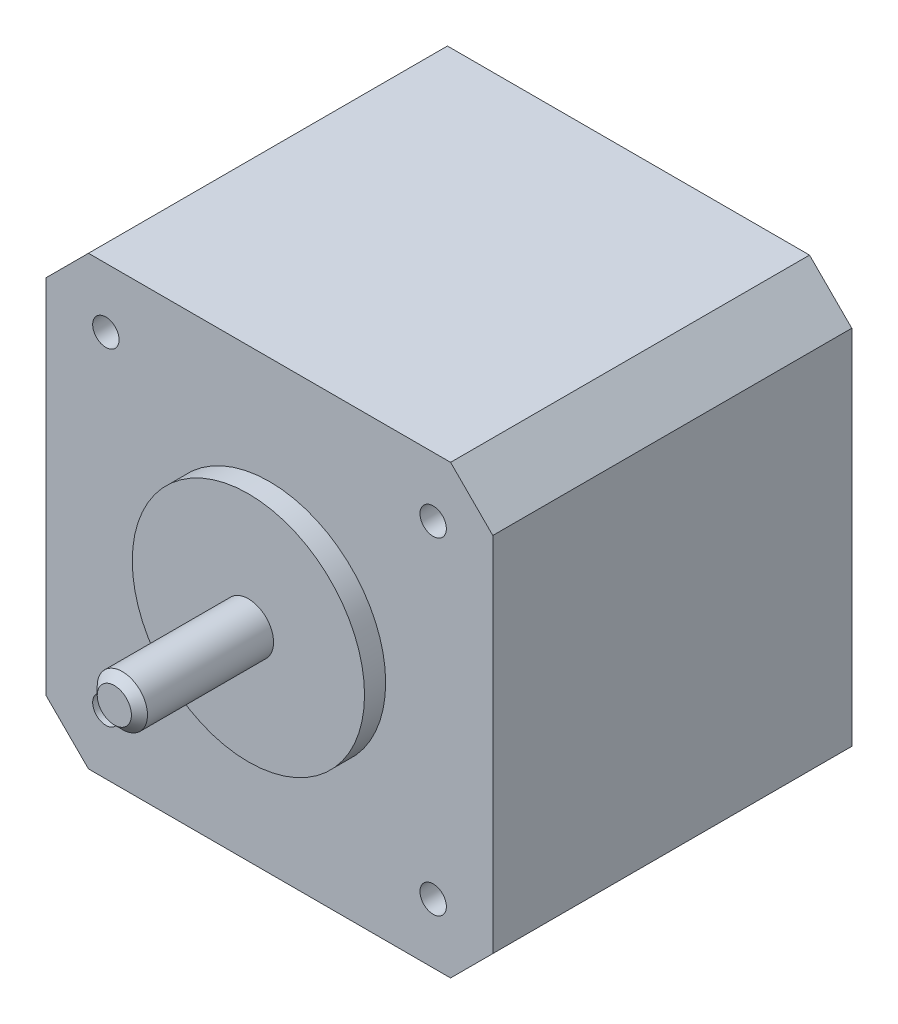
ISO-10303-21;
HEADER;
FILE_DESCRIPTION(('STEP AP214'),'2;1');
FILE_NAME('part.step','',(''),(''),'','','');
FILE_SCHEMA(('AUTOMOTIVE_DESIGN { 1 0 10303 214 1 1 1 1 }'));
ENDSEC;
DATA;
#1=APPLICATION_CONTEXT('core data for automotive mechanical design processes');
#2=APPLICATION_PROTOCOL_DEFINITION('international standard','automotive_design',2000,#1);
#3=PRODUCT_CONTEXT('',#1,'mechanical');
#4=PRODUCT('Part','Part','',(#3));
#5=PRODUCT_RELATED_PRODUCT_CATEGORY('part','',(#4));
#6=PRODUCT_DEFINITION_FORMATION('','',#4);
#7=PRODUCT_DEFINITION_CONTEXT('part definition',#1,'design');
#8=PRODUCT_DEFINITION('design','',#6,#7);
#9=PRODUCT_DEFINITION_SHAPE('','',#8);
#10=(LENGTH_UNIT() NAMED_UNIT(*) SI_UNIT(.MILLI.,.METRE.));
#11=(NAMED_UNIT(*) PLANE_ANGLE_UNIT() SI_UNIT($,.RADIAN.));
#12=(NAMED_UNIT(*) SI_UNIT($,.STERADIAN.) SOLID_ANGLE_UNIT());
#13=UNCERTAINTY_MEASURE_WITH_UNIT(LENGTH_MEASURE(1.E-05),#10,'distance_accuracy_value','');
#14=(GEOMETRIC_REPRESENTATION_CONTEXT(3) GLOBAL_UNCERTAINTY_ASSIGNED_CONTEXT((#13)) GLOBAL_UNIT_ASSIGNED_CONTEXT((#10,
#11,#12)) REPRESENTATION_CONTEXT('',''));
#15=CARTESIAN_POINT('',(0.,0.,0.));
#16=DIRECTION('',(0.,0.,1.));
#17=DIRECTION('',(1.,0.,0.));
#18=AXIS2_PLACEMENT_3D('',#15,#16,#17);
#19=CARTESIAN_POINT('',(0.,0.,36.));
#20=DIRECTION('',(0.,0.,1.));
#21=DIRECTION('',(1.,0.,0.));
#22=AXIS2_PLACEMENT_3D('',#19,#20,#21);
#23=PLANE('',#22);
#24=CARTESIAN_POINT('',(0.,0.,36.));
#25=DIRECTION('',(0.,0.,1.));
#26=DIRECTION('',(1.,0.,0.));
#27=AXIS2_PLACEMENT_3D('',#24,#25,#26);
#28=CIRCLE('',#27,11.);
#29=CARTESIAN_POINT('',(11.,0.,36.));
#30=VERTEX_POINT('',#29);
#31=EDGE_CURVE('E227',#30,#30,#28,.T.);
#32=ORIENTED_EDGE('',*,*,#31,.T.);
#33=EDGE_LOOP('',(#32));
#34=FACE_BOUND('',#33,.T.);
#35=CARTESIAN_POINT('',(0.,0.,36.));
#36=DIRECTION('',(0.,0.,1.));
#37=DIRECTION('',(1.,0.,0.));
#38=AXIS2_PLACEMENT_3D('',#35,#36,#37);
#39=CIRCLE('',#38,2.38125);
#40=CARTESIAN_POINT('',(2.38125,0.,36.));
#41=VERTEX_POINT('',#40);
#42=EDGE_CURVE('E236',#41,#41,#39,.T.);
#43=ORIENTED_EDGE('',*,*,#42,.F.);
#44=EDGE_LOOP('',(#43));
#45=FACE_BOUND('',#44,.T.);
#46=ADVANCED_FACE('F31',(#34,#45),#23,.T.);
#47=CARTESIAN_POINT('',(21.15,21.15,34.));
#48=DIRECTION('',(0.,0.,-1.));
#49=DIRECTION('',(-1.,0.,0.));
#50=AXIS2_PLACEMENT_3D('',#47,#48,#49);
#51=PLANE('',#50);
#52=CARTESIAN_POINT('',(-15.5,-15.5,34.));
#53=DIRECTION('',(0.,0.,1.));
#54=DIRECTION('',(-1.,0.,0.));
#55=AXIS2_PLACEMENT_3D('',#52,#53,#54);
#56=CIRCLE('',#55,1.25);
#57=CARTESIAN_POINT('',(-16.75,-15.5,34.));
#58=VERTEX_POINT('',#57);
#59=EDGE_CURVE('E258',#58,#58,#56,.T.);
#60=ORIENTED_EDGE('',*,*,#59,.F.);
#61=EDGE_LOOP('',(#60));
#62=FACE_BOUND('',#61,.T.);
#63=CARTESIAN_POINT('',(15.5,-15.5,34.));
#64=DIRECTION('',(0.,0.,1.));
#65=DIRECTION('',(1.,0.,0.));
#66=AXIS2_PLACEMENT_3D('',#63,#64,#65);
#67=CIRCLE('',#66,1.25);
#68=CARTESIAN_POINT('',(16.75,-15.5,34.));
#69=VERTEX_POINT('',#68);
#70=EDGE_CURVE('E252',#69,#69,#67,.T.);
#71=ORIENTED_EDGE('',*,*,#70,.F.);
#72=EDGE_LOOP('',(#71));
#73=FACE_BOUND('',#72,.T.);
#74=CARTESIAN_POINT('',(15.5,15.5,34.));
#75=DIRECTION('',(0.,0.,1.));
#76=DIRECTION('',(-1.,0.,0.));
#77=AXIS2_PLACEMENT_3D('',#74,#75,#76);
#78=CIRCLE('',#77,1.25);
#79=CARTESIAN_POINT('',(14.25,15.5,34.));
#80=VERTEX_POINT('',#79);
#81=EDGE_CURVE('E246',#80,#80,#78,.T.);
#82=ORIENTED_EDGE('',*,*,#81,.F.);
#83=EDGE_LOOP('',(#82));
#84=FACE_BOUND('',#83,.T.);
#85=CARTESIAN_POINT('',(-15.5,15.5,34.));
#86=DIRECTION('',(0.,0.,1.));
#87=DIRECTION('',(1.,0.,0.));
#88=AXIS2_PLACEMENT_3D('',#85,#86,#87);
#89=CIRCLE('',#88,1.25);
#90=CARTESIAN_POINT('',(-14.25,15.5,34.));
#91=VERTEX_POINT('',#90);
#92=EDGE_CURVE('E240',#91,#91,#89,.T.);
#93=ORIENTED_EDGE('',*,*,#92,.F.);
#94=EDGE_LOOP('',(#93));
#95=FACE_BOUND('',#94,.T.);
#96=DIRECTION('',(0.,-1.,0.));
#97=VECTOR('',#96,1.);
#98=CARTESIAN_POINT('',(-21.15,-21.15,34.));
#99=LINE('',#98,#97);
#100=CARTESIAN_POINT('',(-21.15,17.15,34.));
#101=VERTEX_POINT('',#100);
#102=CARTESIAN_POINT('',(-21.15,-17.15,34.));
#103=VERTEX_POINT('',#102);
#104=EDGE_CURVE('E231',#101,#103,#99,.T.);
#105=ORIENTED_EDGE('',*,*,#104,.T.);
#106=DIRECTION('',(-0.707106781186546,0.707106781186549,0.));
#107=VECTOR('',#106,1.);
#108=CARTESIAN_POINT('',(-17.15,-21.15,34.));
#109=LINE('',#108,#107);
#110=CARTESIAN_POINT('',(-17.15,-21.15,34.));
#111=VERTEX_POINT('',#110);
#112=EDGE_CURVE('E146',#103,#111,#109,.F.);
#113=ORIENTED_EDGE('',*,*,#112,.T.);
#114=DIRECTION('',(1.,0.,0.));
#115=VECTOR('',#114,1.);
#116=CARTESIAN_POINT('',(-21.15,-21.15,34.));
#117=LINE('',#116,#115);
#118=CARTESIAN_POINT('',(17.15,-21.15,34.));
#119=VERTEX_POINT('',#118);
#120=EDGE_CURVE('E118',#111,#119,#117,.T.);
#121=ORIENTED_EDGE('',*,*,#120,.T.);
#122=DIRECTION('',(-0.707106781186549,-0.707106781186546,0.));
#123=VECTOR('',#122,1.);
#124=CARTESIAN_POINT('',(21.15,-17.15,34.));
#125=LINE('',#124,#123);
#126=CARTESIAN_POINT('',(21.15,-17.15,34.));
#127=VERTEX_POINT('',#126);
#128=EDGE_CURVE('E144',#119,#127,#125,.F.);
#129=ORIENTED_EDGE('',*,*,#128,.T.);
#130=DIRECTION('',(0.,1.,0.));
#131=VECTOR('',#130,1.);
#132=CARTESIAN_POINT('',(21.15,-21.15,34.));
#133=LINE('',#132,#131);
#134=CARTESIAN_POINT('',(21.15,17.15,34.));
#135=VERTEX_POINT('',#134);
#136=EDGE_CURVE('E124',#127,#135,#133,.T.);
#137=ORIENTED_EDGE('',*,*,#136,.T.);
#138=DIRECTION('',(0.707106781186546,-0.707106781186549,0.));
#139=VECTOR('',#138,1.);
#140=CARTESIAN_POINT('',(17.15,21.15,34.));
#141=LINE('',#140,#139);
#142=CARTESIAN_POINT('',(17.15,21.15,34.));
#143=VERTEX_POINT('',#142);
#144=EDGE_CURVE('E53',#135,#143,#141,.F.);
#145=ORIENTED_EDGE('',*,*,#144,.T.);
#146=DIRECTION('',(-1.,0.,0.));
#147=VECTOR('',#146,1.);
#148=CARTESIAN_POINT('',(-21.15,21.15,34.));
#149=LINE('',#148,#147);
#150=CARTESIAN_POINT('',(-17.15,21.15,34.));
#151=VERTEX_POINT('',#150);
#152=EDGE_CURVE('E127',#143,#151,#149,.T.);
#153=ORIENTED_EDGE('',*,*,#152,.T.);
#154=DIRECTION('',(0.707106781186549,0.707106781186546,0.));
#155=VECTOR('',#154,1.);
#156=CARTESIAN_POINT('',(-21.15,17.15,34.));
#157=LINE('',#156,#155);
#158=EDGE_CURVE('E142',#151,#101,#157,.F.);
#159=ORIENTED_EDGE('',*,*,#158,.T.);
#160=EDGE_LOOP('',(#105,#113,#121,#129,#137,#145,#153,#159));
#161=FACE_BOUND('',#160,.T.);
#162=CARTESIAN_POINT('',(0.,0.,34.));
#163=DIRECTION('',(0.,0.,-1.));
#164=DIRECTION('',(-1.,0.,0.));
#165=AXIS2_PLACEMENT_3D('',#162,#163,#164);
#166=CIRCLE('',#165,11.);
#167=CARTESIAN_POINT('',(-11.,0.,34.));
#168=VERTEX_POINT('',#167);
#169=EDGE_CURVE('E157',#168,#168,#166,.F.);
#170=ORIENTED_EDGE('',*,*,#169,.F.);
#171=EDGE_LOOP('',(#170));
#172=FACE_BOUND('',#171,.T.);
#173=ADVANCED_FACE('F175',(#62,#73,#84,#95,#161,#172),#51,.F.);
#174=CARTESIAN_POINT('',(21.15,-21.15,34.));
#175=DIRECTION('',(-1.,0.,0.));
#176=DIRECTION('',(0.,0.,1.));
#177=AXIS2_PLACEMENT_3D('',#174,#175,#176);
#178=PLANE('',#177);
#179=ORIENTED_EDGE('',*,*,#136,.F.);
#180=DIRECTION('',(0.,0.,-1.));
#181=VECTOR('',#180,1.);
#182=CARTESIAN_POINT('',(21.15,-17.15,34.));
#183=LINE('',#182,#181);
#184=CARTESIAN_POINT('',(21.15,-17.15,0.));
#185=VERTEX_POINT('',#184);
#186=EDGE_CURVE('E150',#127,#185,#183,.T.);
#187=ORIENTED_EDGE('',*,*,#186,.T.);
#188=DIRECTION('',(0.,1.,0.));
#189=VECTOR('',#188,1.);
#190=CARTESIAN_POINT('',(21.15,-21.15,0.));
#191=LINE('',#190,#189);
#192=CARTESIAN_POINT('',(21.15,17.15,0.));
#193=VERTEX_POINT('',#192);
#194=EDGE_CURVE('E226',#185,#193,#191,.T.);
#195=ORIENTED_EDGE('',*,*,#194,.T.);
#196=DIRECTION('',(0.,0.,1.));
#197=VECTOR('',#196,1.);
#198=CARTESIAN_POINT('',(21.15,17.15,34.));
#199=LINE('',#198,#197);
#200=EDGE_CURVE('E148',#193,#135,#199,.T.);
#201=ORIENTED_EDGE('',*,*,#200,.T.);
#202=EDGE_LOOP('',(#179,#187,#195,#201));
#203=FACE_BOUND('',#202,.T.);
#204=ADVANCED_FACE('F181',(#203),#178,.F.);
#205=CARTESIAN_POINT('',(-21.15,21.15,34.));
#206=DIRECTION('',(0.,-1.,0.));
#207=DIRECTION('',(0.,0.,-1.));
#208=AXIS2_PLACEMENT_3D('',#205,#206,#207);
#209=PLANE('',#208);
#210=DIRECTION('',(-1.,0.,0.));
#211=VECTOR('',#210,1.);
#212=CARTESIAN_POINT('',(-21.15,21.15,0.));
#213=LINE('',#212,#211);
#214=CARTESIAN_POINT('',(17.15,21.15,0.));
#215=VERTEX_POINT('',#214);
#216=CARTESIAN_POINT('',(-17.15,21.15,0.));
#217=VERTEX_POINT('',#216);
#218=EDGE_CURVE('E129',#215,#217,#213,.T.);
#219=ORIENTED_EDGE('',*,*,#218,.T.);
#220=DIRECTION('',(0.,0.,1.));
#221=VECTOR('',#220,1.);
#222=CARTESIAN_POINT('',(-17.15,21.15,34.));
#223=LINE('',#222,#221);
#224=EDGE_CURVE('E46',#217,#151,#223,.T.);
#225=ORIENTED_EDGE('',*,*,#224,.T.);
#226=ORIENTED_EDGE('',*,*,#152,.F.);
#227=DIRECTION('',(0.,0.,-1.));
#228=VECTOR('',#227,1.);
#229=CARTESIAN_POINT('',(17.15,21.15,34.));
#230=LINE('',#229,#228);
#231=EDGE_CURVE('E153',#143,#215,#230,.T.);
#232=ORIENTED_EDGE('',*,*,#231,.T.);
#233=EDGE_LOOP('',(#219,#225,#226,#232));
#234=FACE_BOUND('',#233,.T.);
#235=ADVANCED_FACE('F202',(#234),#209,.F.);
#236=CARTESIAN_POINT('',(-21.15,-21.15,34.));
#237=DIRECTION('',(1.,0.,0.));
#238=DIRECTION('',(0.,0.,-1.));
#239=AXIS2_PLACEMENT_3D('',#236,#237,#238);
#240=PLANE('',#239);
#241=DIRECTION('',(0.,-1.,0.));
#242=VECTOR('',#241,1.);
#243=CARTESIAN_POINT('',(-21.15,-21.15,0.));
#244=LINE('',#243,#242);
#245=CARTESIAN_POINT('',(-21.15,17.15,0.));
#246=VERTEX_POINT('',#245);
#247=CARTESIAN_POINT('',(-21.15,-17.15,0.));
#248=VERTEX_POINT('',#247);
#249=EDGE_CURVE('E125',#246,#248,#244,.T.);
#250=ORIENTED_EDGE('',*,*,#249,.T.);
#251=DIRECTION('',(0.,0.,1.));
#252=VECTOR('',#251,1.);
#253=CARTESIAN_POINT('',(-21.15,-17.15,34.));
#254=LINE('',#253,#252);
#255=EDGE_CURVE('E103',#248,#103,#254,.T.);
#256=ORIENTED_EDGE('',*,*,#255,.T.);
#257=ORIENTED_EDGE('',*,*,#104,.F.);
#258=DIRECTION('',(0.,0.,-1.));
#259=VECTOR('',#258,1.);
#260=CARTESIAN_POINT('',(-21.15,17.15,34.));
#261=LINE('',#260,#259);
#262=EDGE_CURVE('E108',#101,#246,#261,.T.);
#263=ORIENTED_EDGE('',*,*,#262,.T.);
#264=EDGE_LOOP('',(#250,#256,#257,#263));
#265=FACE_BOUND('',#264,.T.);
#266=ADVANCED_FACE('F199',(#265),#240,.F.);
#267=CARTESIAN_POINT('',(-21.15,-21.15,34.));
#268=DIRECTION('',(0.,1.,0.));
#269=DIRECTION('',(0.,0.,1.));
#270=AXIS2_PLACEMENT_3D('',#267,#268,#269);
#271=PLANE('',#270);
#272=ORIENTED_EDGE('',*,*,#120,.F.);
#273=DIRECTION('',(0.,0.,-1.));
#274=VECTOR('',#273,1.);
#275=CARTESIAN_POINT('',(-17.15,-21.15,34.));
#276=LINE('',#275,#274);
#277=CARTESIAN_POINT('',(-17.15,-21.15,0.));
#278=VERTEX_POINT('',#277);
#279=EDGE_CURVE('E102',#111,#278,#276,.T.);
#280=ORIENTED_EDGE('',*,*,#279,.T.);
#281=DIRECTION('',(1.,0.,0.));
#282=VECTOR('',#281,1.);
#283=CARTESIAN_POINT('',(-21.15,-21.15,0.));
#284=LINE('',#283,#282);
#285=CARTESIAN_POINT('',(17.15,-21.15,0.));
#286=VERTEX_POINT('',#285);
#287=EDGE_CURVE('E115',#278,#286,#284,.T.);
#288=ORIENTED_EDGE('',*,*,#287,.T.);
#289=DIRECTION('',(0.,0.,1.));
#290=VECTOR('',#289,1.);
#291=CARTESIAN_POINT('',(17.15,-21.15,34.));
#292=LINE('',#291,#290);
#293=EDGE_CURVE('E120',#286,#119,#292,.T.);
#294=ORIENTED_EDGE('',*,*,#293,.T.);
#295=EDGE_LOOP('',(#272,#280,#288,#294));
#296=FACE_BOUND('',#295,.T.);
#297=ADVANCED_FACE('F114',(#296),#271,.F.);
#298=CARTESIAN_POINT('',(21.15,21.15,0.));
#299=DIRECTION('',(0.,0.,-1.));
#300=DIRECTION('',(-1.,0.,0.));
#301=AXIS2_PLACEMENT_3D('',#298,#299,#300);
#302=PLANE('',#301);
#303=ORIENTED_EDGE('',*,*,#287,.F.);
#304=DIRECTION('',(0.707106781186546,-0.707106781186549,0.));
#305=VECTOR('',#304,1.);
#306=CARTESIAN_POINT('',(-19.1500000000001,-19.1499999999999,0.));
#307=LINE('',#306,#305);
#308=EDGE_CURVE('E98',#278,#248,#307,.F.);
#309=ORIENTED_EDGE('',*,*,#308,.T.);
#310=ORIENTED_EDGE('',*,*,#249,.F.);
#311=DIRECTION('',(-0.707106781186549,-0.707106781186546,0.));
#312=VECTOR('',#311,1.);
#313=CARTESIAN_POINT('',(2.00000000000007,40.3,0.));
#314=LINE('',#313,#312);
#315=EDGE_CURVE('E135',#246,#217,#314,.F.);
#316=ORIENTED_EDGE('',*,*,#315,.T.);
#317=ORIENTED_EDGE('',*,*,#218,.F.);
#318=DIRECTION('',(-0.707106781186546,0.707106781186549,0.));
#319=VECTOR('',#318,1.);
#320=CARTESIAN_POINT('',(19.15,19.15,0.));
#321=LINE('',#320,#319);
#322=EDGE_CURVE('E119',#215,#193,#321,.F.);
#323=ORIENTED_EDGE('',*,*,#322,.T.);
#324=ORIENTED_EDGE('',*,*,#194,.F.);
#325=DIRECTION('',(0.707106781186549,0.707106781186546,0.));
#326=VECTOR('',#325,1.);
#327=CARTESIAN_POINT('',(40.3,1.99999999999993,0.));
#328=LINE('',#327,#326);
#329=EDGE_CURVE('E109',#185,#286,#328,.F.);
#330=ORIENTED_EDGE('',*,*,#329,.T.);
#331=EDGE_LOOP('',(#303,#309,#310,#316,#317,#323,#324,#330));
#332=FACE_BOUND('',#331,.T.);
#333=ADVANCED_FACE('F122',(#332),#302,.T.);
#334=CARTESIAN_POINT('',(-17.15,-21.15,34.));
#335=DIRECTION('',(0.707106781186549,0.707106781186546,0.));
#336=DIRECTION('',(-0.707106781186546,0.707106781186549,0.));
#337=AXIS2_PLACEMENT_3D('',#334,#335,#336);
#338=PLANE('',#337);
#339=ORIENTED_EDGE('',*,*,#112,.F.);
#340=ORIENTED_EDGE('',*,*,#255,.F.);
#341=ORIENTED_EDGE('',*,*,#308,.F.);
#342=ORIENTED_EDGE('',*,*,#279,.F.);
#343=EDGE_LOOP('',(#339,#340,#341,#342));
#344=FACE_BOUND('',#343,.T.);
#345=ADVANCED_FACE('F101',(#344),#338,.F.);
#346=CARTESIAN_POINT('',(21.15,-17.15,34.));
#347=DIRECTION('',(-0.707106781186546,0.707106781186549,0.));
#348=DIRECTION('',(-0.707106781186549,-0.707106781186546,0.));
#349=AXIS2_PLACEMENT_3D('',#346,#347,#348);
#350=PLANE('',#349);
#351=ORIENTED_EDGE('',*,*,#128,.F.);
#352=ORIENTED_EDGE('',*,*,#293,.F.);
#353=ORIENTED_EDGE('',*,*,#329,.F.);
#354=ORIENTED_EDGE('',*,*,#186,.F.);
#355=EDGE_LOOP('',(#351,#352,#353,#354));
#356=FACE_BOUND('',#355,.T.);
#357=ADVANCED_FACE('F211',(#356),#350,.F.);
#358=CARTESIAN_POINT('',(-21.15,17.15,34.));
#359=DIRECTION('',(0.707106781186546,-0.707106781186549,0.));
#360=DIRECTION('',(0.707106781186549,0.707106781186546,0.));
#361=AXIS2_PLACEMENT_3D('',#358,#359,#360);
#362=PLANE('',#361);
#363=ORIENTED_EDGE('',*,*,#158,.F.);
#364=ORIENTED_EDGE('',*,*,#224,.F.);
#365=ORIENTED_EDGE('',*,*,#315,.F.);
#366=ORIENTED_EDGE('',*,*,#262,.F.);
#367=EDGE_LOOP('',(#363,#364,#365,#366));
#368=FACE_BOUND('',#367,.T.);
#369=ADVANCED_FACE('F214',(#368),#362,.F.);
#370=CARTESIAN_POINT('',(17.15,21.15,34.));
#371=DIRECTION('',(-0.707106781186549,-0.707106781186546,0.));
#372=DIRECTION('',(0.707106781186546,-0.707106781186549,0.));
#373=AXIS2_PLACEMENT_3D('',#370,#371,#372);
#374=PLANE('',#373);
#375=ORIENTED_EDGE('',*,*,#144,.F.);
#376=ORIENTED_EDGE('',*,*,#200,.F.);
#377=ORIENTED_EDGE('',*,*,#322,.F.);
#378=ORIENTED_EDGE('',*,*,#231,.F.);
#379=EDGE_LOOP('',(#375,#376,#377,#378));
#380=FACE_BOUND('',#379,.T.);
#381=ADVANCED_FACE('F192',(#380),#374,.F.);
#382=CARTESIAN_POINT('',(0.,0.,36.));
#383=DIRECTION('',(0.,0.,-1.));
#384=DIRECTION('',(-1.,0.,0.));
#385=AXIS2_PLACEMENT_3D('',#382,#383,#384);
#386=CYLINDRICAL_SURFACE('',#385,11.);
#387=ORIENTED_EDGE('',*,*,#31,.F.);
#388=EDGE_LOOP('',(#387));
#389=FACE_BOUND('',#388,.T.);
#390=ORIENTED_EDGE('',*,*,#169,.T.);
#391=EDGE_LOOP('',(#390));
#392=FACE_BOUND('',#391,.T.);
#393=ADVANCED_FACE('F190',(#389,#392),#386,.T.);
#394=CARTESIAN_POINT('',(0.,0.,48.7));
#395=DIRECTION('',(0.,0.,-1.));
#396=DIRECTION('',(-1.,0.,0.));
#397=AXIS2_PLACEMENT_3D('',#394,#395,#396);
#398=CYLINDRICAL_SURFACE('',#397,2.38125);
#399=CARTESIAN_POINT('',(0.,0.,47.938));
#400=DIRECTION('',(0.,0.,1.));
#401=DIRECTION('',(1.,0.,0.));
#402=AXIS2_PLACEMENT_3D('',#399,#400,#401);
#403=CIRCLE('',#402,2.38125);
#404=CARTESIAN_POINT('',(-2.38125,0.,47.938));
#405=VERTEX_POINT('',#404);
#406=EDGE_CURVE('E11',#405,#405,#403,.F.);
#407=ORIENTED_EDGE('',*,*,#406,.T.);
#408=EDGE_LOOP('',(#407));
#409=FACE_BOUND('',#408,.T.);
#410=ORIENTED_EDGE('',*,*,#42,.T.);
#411=EDGE_LOOP('',(#410));
#412=FACE_BOUND('',#411,.T.);
#413=ADVANCED_FACE('F188',(#409,#412),#398,.T.);
#414=CARTESIAN_POINT('',(0.,0.,48.7));
#415=DIRECTION('',(0.,0.,1.));
#416=DIRECTION('',(1.,0.,0.));
#417=AXIS2_PLACEMENT_3D('',#414,#415,#416);
#418=PLANE('',#417);
#419=CARTESIAN_POINT('',(0.,0.,48.7));
#420=DIRECTION('',(0.,0.,1.));
#421=DIRECTION('',(1.,0.,0.));
#422=AXIS2_PLACEMENT_3D('',#419,#420,#421);
#423=CIRCLE('',#422,1.61924999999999);
#424=CARTESIAN_POINT('',(-1.61924999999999,0.,48.7));
#425=VERTEX_POINT('',#424);
#426=EDGE_CURVE('E39',#425,#425,#423,.T.);
#427=ORIENTED_EDGE('',*,*,#426,.T.);
#428=EDGE_LOOP('',(#427));
#429=FACE_BOUND('',#428,.T.);
#430=ADVANCED_FACE('F162',(#429),#418,.T.);
#431=CARTESIAN_POINT('',(-15.5,15.5,29.5));
#432=DIRECTION('',(0.,0.,1.));
#433=DIRECTION('',(1.,0.,0.));
#434=AXIS2_PLACEMENT_3D('',#431,#432,#433);
#435=CYLINDRICAL_SURFACE('',#434,1.25);
#436=CARTESIAN_POINT('',(-15.5,15.5,29.5));
#437=DIRECTION('',(0.,0.,1.));
#438=DIRECTION('',(1.,0.,0.));
#439=AXIS2_PLACEMENT_3D('',#436,#437,#438);
#440=CIRCLE('',#439,1.25);
#441=CARTESIAN_POINT('',(-14.25,15.5,29.5));
#442=VERTEX_POINT('',#441);
#443=EDGE_CURVE('E239',#442,#442,#440,.T.);
#444=ORIENTED_EDGE('',*,*,#443,.F.);
#445=EDGE_LOOP('',(#444));
#446=FACE_BOUND('',#445,.T.);
#447=ORIENTED_EDGE('',*,*,#92,.T.);
#448=EDGE_LOOP('',(#447));
#449=FACE_BOUND('',#448,.T.);
#450=ADVANCED_FACE('F285',(#446,#449),#435,.F.);
#451=CARTESIAN_POINT('',(-15.5,15.5,29.5));
#452=DIRECTION('',(0.,0.,1.));
#453=DIRECTION('',(1.,0.,0.));
#454=AXIS2_PLACEMENT_3D('',#451,#452,#453);
#455=PLANE('',#454);
#456=ORIENTED_EDGE('',*,*,#443,.T.);
#457=EDGE_LOOP('',(#456));
#458=FACE_BOUND('',#457,.T.);
#459=ADVANCED_FACE('F287',(#458),#455,.T.);
#460=CARTESIAN_POINT('',(15.5,15.5,29.5));
#461=DIRECTION('',(0.,0.,1.));
#462=DIRECTION('',(1.,0.,0.));
#463=AXIS2_PLACEMENT_3D('',#460,#461,#462);
#464=CYLINDRICAL_SURFACE('',#463,1.25);
#465=CARTESIAN_POINT('',(15.5,15.5,29.5));
#466=DIRECTION('',(0.,0.,1.));
#467=DIRECTION('',(-1.,0.,0.));
#468=AXIS2_PLACEMENT_3D('',#465,#466,#467);
#469=CIRCLE('',#468,1.25);
#470=CARTESIAN_POINT('',(14.25,15.5,29.5));
#471=VERTEX_POINT('',#470);
#472=EDGE_CURVE('E243',#471,#471,#469,.T.);
#473=ORIENTED_EDGE('',*,*,#472,.F.);
#474=EDGE_LOOP('',(#473));
#475=FACE_BOUND('',#474,.T.);
#476=ORIENTED_EDGE('',*,*,#81,.T.);
#477=EDGE_LOOP('',(#476));
#478=FACE_BOUND('',#477,.T.);
#479=ADVANCED_FACE('F294',(#475,#478),#464,.F.);
#480=CARTESIAN_POINT('',(15.5,15.5,29.5));
#481=DIRECTION('',(0.,0.,-1.));
#482=DIRECTION('',(-1.,0.,0.));
#483=AXIS2_PLACEMENT_3D('',#480,#481,#482);
#484=PLANE('',#483);
#485=ORIENTED_EDGE('',*,*,#472,.T.);
#486=EDGE_LOOP('',(#485));
#487=FACE_BOUND('',#486,.T.);
#488=ADVANCED_FACE('F301',(#487),#484,.F.);
#489=CARTESIAN_POINT('',(15.5,-15.5,29.5));
#490=DIRECTION('',(0.,0.,1.));
#491=DIRECTION('',(1.,0.,0.));
#492=AXIS2_PLACEMENT_3D('',#489,#490,#491);
#493=CYLINDRICAL_SURFACE('',#492,1.25);
#494=CARTESIAN_POINT('',(15.5,-15.5,29.5));
#495=DIRECTION('',(0.,0.,1.));
#496=DIRECTION('',(1.,0.,0.));
#497=AXIS2_PLACEMENT_3D('',#494,#495,#496);
#498=CIRCLE('',#497,1.25);
#499=CARTESIAN_POINT('',(16.75,-15.5,29.5));
#500=VERTEX_POINT('',#499);
#501=EDGE_CURVE('E249',#500,#500,#498,.T.);
#502=ORIENTED_EDGE('',*,*,#501,.F.);
#503=EDGE_LOOP('',(#502));
#504=FACE_BOUND('',#503,.T.);
#505=ORIENTED_EDGE('',*,*,#70,.T.);
#506=EDGE_LOOP('',(#505));
#507=FACE_BOUND('',#506,.T.);
#508=ADVANCED_FACE('F305',(#504,#507),#493,.F.);
#509=CARTESIAN_POINT('',(15.5,-15.5,29.5));
#510=DIRECTION('',(0.,0.,1.));
#511=DIRECTION('',(1.,0.,0.));
#512=AXIS2_PLACEMENT_3D('',#509,#510,#511);
#513=PLANE('',#512);
#514=ORIENTED_EDGE('',*,*,#501,.T.);
#515=EDGE_LOOP('',(#514));
#516=FACE_BOUND('',#515,.T.);
#517=ADVANCED_FACE('F266',(#516),#513,.T.);
#518=CARTESIAN_POINT('',(-15.5,-15.5,29.5));
#519=DIRECTION('',(0.,0.,1.));
#520=DIRECTION('',(1.,0.,0.));
#521=AXIS2_PLACEMENT_3D('',#518,#519,#520);
#522=CYLINDRICAL_SURFACE('',#521,1.25);
#523=CARTESIAN_POINT('',(-15.5,-15.5,29.5));
#524=DIRECTION('',(0.,0.,1.));
#525=DIRECTION('',(-1.,0.,0.));
#526=AXIS2_PLACEMENT_3D('',#523,#524,#525);
#527=CIRCLE('',#526,1.25);
#528=CARTESIAN_POINT('',(-16.75,-15.5,29.5));
#529=VERTEX_POINT('',#528);
#530=EDGE_CURVE('E255',#529,#529,#527,.T.);
#531=ORIENTED_EDGE('',*,*,#530,.F.);
#532=EDGE_LOOP('',(#531));
#533=FACE_BOUND('',#532,.T.);
#534=ORIENTED_EDGE('',*,*,#59,.T.);
#535=EDGE_LOOP('',(#534));
#536=FACE_BOUND('',#535,.T.);
#537=ADVANCED_FACE('F170',(#533,#536),#522,.F.);
#538=CARTESIAN_POINT('',(-15.5,-15.5,29.5));
#539=DIRECTION('',(0.,0.,-1.));
#540=DIRECTION('',(-1.,0.,0.));
#541=AXIS2_PLACEMENT_3D('',#538,#539,#540);
#542=PLANE('',#541);
#543=ORIENTED_EDGE('',*,*,#530,.T.);
#544=EDGE_LOOP('',(#543));
#545=FACE_BOUND('',#544,.T.);
#546=ADVANCED_FACE('F165',(#545),#542,.F.);
#547=CARTESIAN_POINT('',(0.,0.,48.7));
#548=DIRECTION('',(0.,0.,-1.));
#549=DIRECTION('',(-1.,0.,0.));
#550=AXIS2_PLACEMENT_3D('',#547,#548,#549);
#551=CONICAL_SURFACE('',#550,1.61924999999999,0.785398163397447);
#552=CARTESIAN_POINT('',(-2.38125,0.,47.938));
#553=CARTESIAN_POINT('',(-2.37331250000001,0.,47.9459375));
#554=CARTESIAN_POINT('',(-2.36537500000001,0.,47.953875));
#555=CARTESIAN_POINT('',(-2.3495,0.,47.96975));
#556=CARTESIAN_POINT('',(-2.3415625,0.,47.9776875));
#557=CARTESIAN_POINT('',(-2.3256875,0.,47.9935625));
#558=CARTESIAN_POINT('',(-2.31775,0.,48.0015));
#559=CARTESIAN_POINT('',(-2.301875,0.,48.017375));
#560=CARTESIAN_POINT('',(-2.2939375,0.,48.0253125));
#561=CARTESIAN_POINT('',(-2.2780625,0.,48.0411875));
#562=CARTESIAN_POINT('',(-2.270125,0.,48.049125));
#563=CARTESIAN_POINT('',(-2.25425,0.,48.065));
#564=CARTESIAN_POINT('',(-2.2463125,0.,48.0729375));
#565=CARTESIAN_POINT('',(-2.2304375,0.,48.0888125));
#566=CARTESIAN_POINT('',(-2.2225,0.,48.09675));
#567=CARTESIAN_POINT('',(-2.206625,0.,48.112625));
#568=CARTESIAN_POINT('',(-2.1986875,0.,48.1205625));
#569=CARTESIAN_POINT('',(-2.1828125,0.,48.1364375));
#570=CARTESIAN_POINT('',(-2.174875,0.,48.144375));
#571=CARTESIAN_POINT('',(-2.159,0.,48.16025));
#572=CARTESIAN_POINT('',(-2.1510625,0.,48.1681875));
#573=CARTESIAN_POINT('',(-2.1351875,0.,48.1840625));
#574=CARTESIAN_POINT('',(-2.12725,0.,48.192));
#575=CARTESIAN_POINT('',(-2.111375,0.,48.207875));
#576=CARTESIAN_POINT('',(-2.1034375,0.,48.2158125));
#577=CARTESIAN_POINT('',(-2.0875625,0.,48.2316875));
#578=CARTESIAN_POINT('',(-2.079625,0.,48.239625));
#579=CARTESIAN_POINT('',(-2.06375,0.,48.2555));
#580=CARTESIAN_POINT('',(-2.0558125,0.,48.2634375));
#581=CARTESIAN_POINT('',(-2.0399375,0.,48.2793125));
#582=CARTESIAN_POINT('',(-2.032,0.,48.28725));
#583=CARTESIAN_POINT('',(-2.016125,0.,48.303125));
#584=CARTESIAN_POINT('',(-2.0081875,0.,48.3110625));
#585=CARTESIAN_POINT('',(-1.9923125,0.,48.3269375));
#586=CARTESIAN_POINT('',(-1.984375,0.,48.334875));
#587=CARTESIAN_POINT('',(-1.9685,0.,48.35075));
#588=CARTESIAN_POINT('',(-1.9605625,0.,48.3586875));
#589=CARTESIAN_POINT('',(-1.9446875,0.,48.3745625));
#590=CARTESIAN_POINT('',(-1.93675,0.,48.3825));
#591=CARTESIAN_POINT('',(-1.920875,0.,48.398375));
#592=CARTESIAN_POINT('',(-1.9129375,0.,48.4063125));
#593=CARTESIAN_POINT('',(-1.8970625,0.,48.4221875));
#594=CARTESIAN_POINT('',(-1.889125,0.,48.430125));
#595=CARTESIAN_POINT('',(-1.87325,0.,48.446));
#596=CARTESIAN_POINT('',(-1.8653125,0.,48.4539375));
#597=CARTESIAN_POINT('',(-1.8494375,0.,48.4698125));
#598=CARTESIAN_POINT('',(-1.8415,0.,48.47775));
#599=CARTESIAN_POINT('',(-1.82562499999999,0.,48.493625));
#600=CARTESIAN_POINT('',(-1.8176875,0.,48.5015625));
#601=CARTESIAN_POINT('',(-1.8018125,0.,48.5174375));
#602=CARTESIAN_POINT('',(-1.793875,0.,48.525375));
#603=CARTESIAN_POINT('',(-1.77799999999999,0.,48.54125));
#604=CARTESIAN_POINT('',(-1.77006249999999,0.,48.5491875));
#605=CARTESIAN_POINT('',(-1.75418749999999,0.,48.5650625));
#606=CARTESIAN_POINT('',(-1.74624999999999,0.,48.573));
#607=CARTESIAN_POINT('',(-1.73037499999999,0.,48.588875));
#608=CARTESIAN_POINT('',(-1.72243749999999,0.,48.5968125));
#609=CARTESIAN_POINT('',(-1.70656249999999,0.,48.6126875));
#610=CARTESIAN_POINT('',(-1.69862499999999,0.,48.620625));
#611=CARTESIAN_POINT('',(-1.68274999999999,0.,48.6365));
#612=CARTESIAN_POINT('',(-1.67481249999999,0.,48.6444375));
#613=CARTESIAN_POINT('',(-1.65893749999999,0.,48.6603125));
#614=CARTESIAN_POINT('',(-1.65099999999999,0.,48.66825));
#615=CARTESIAN_POINT('',(-1.63512499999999,0.,48.684125));
#616=CARTESIAN_POINT('',(-1.62718749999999,0.,48.6920625));
#617=CARTESIAN_POINT('',(-1.61924999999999,0.,48.7));
#618=B_SPLINE_CURVE_WITH_KNOTS('',3,(#552,#553,#554,#555,#556,#557,#558,#559,#560,#561,#562,
#563,#564,#565,#566,#567,#568,#569,#570,#571,#572,#573,#574,#575,#576,#577,#578,#579,#580,#581,
#582,#583,#584,#585,#586,#587,#588,#589,#590,#591,#592,#593,#594,#595,#596,#597,#598,#599,#600,
#601,#602,#603,#604,#605,#606,#607,#608,#609,#610,#611,#612,#613,#614,#615,#616,#617),
.UNSPECIFIED.,.F.,.F.,(4,2,2,2,2,2,2,2,2,2,2,2,2,2,2,2,2,2,2,2,2,2,2,2,2,2,2,2,2,2,2,2,4),(0.,
0.033675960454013,0.067351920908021,0.101027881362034,0.134703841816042,0.16837980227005,
0.202055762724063,0.235731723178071,0.269407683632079,0.303083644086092,0.3367596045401,
0.370435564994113,0.404111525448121,0.437787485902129,0.471463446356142,0.50513940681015,
0.538815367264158,0.572491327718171,0.606167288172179,0.639843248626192,0.6735192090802,
0.707195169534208,0.740871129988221,0.774547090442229,0.808223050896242,0.84189901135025,
0.875574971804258,0.909250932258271,0.942926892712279,0.976602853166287,1.0102788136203,
1.04395477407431,1.07763073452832),.UNSPECIFIED.);
#619=EDGE_CURVE('BSEAM33',#405,#425,#618,.T.);
#620=ORIENTED_EDGE('',*,*,#406,.F.);
#621=ORIENTED_EDGE('',*,*,#426,.F.);
#622=ORIENTED_EDGE('',*,*,#619,.T.);
#623=ORIENTED_EDGE('',*,*,#619,.F.);
#624=EDGE_LOOP('',(#620,#622,#621,#623));
#625=FACE_BOUND('',#624,.T.);
#626=ADVANCED_FACE('F33',(#625),#551,.T.);
#627=CLOSED_SHELL('',(#46,#173,#204,#235,#266,#297,#333,#345,#357,#369,#381,#393,#413,#430,#450,
#459,#479,#488,#508,#517,#537,#546,#626));
#628=MANIFOLD_SOLID_BREP('B2',#627);
#629=ADVANCED_BREP_SHAPE_REPRESENTATION('',(#18,#628),#14);
#630=SHAPE_DEFINITION_REPRESENTATION(#9,#629);
ENDSEC;
END-ISO-10303-21;
